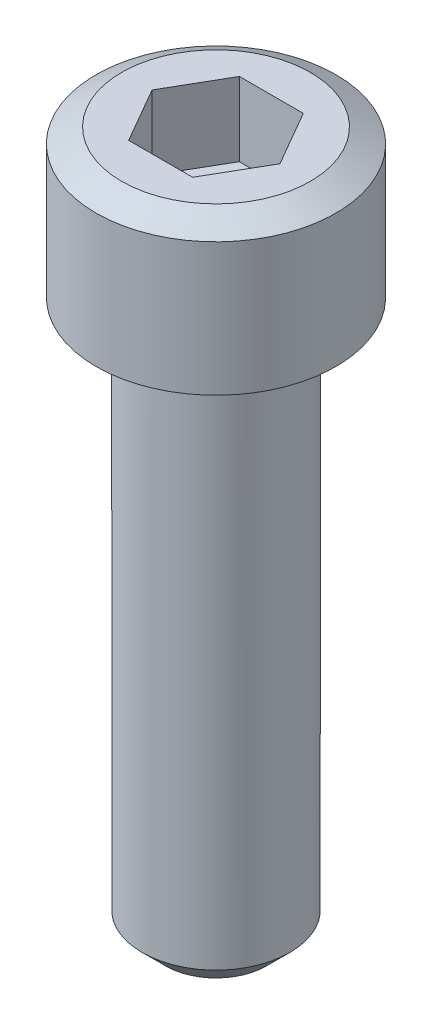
ISO-10303-21;
HEADER;
FILE_DESCRIPTION(('STEP AP214'),'2;1');
FILE_NAME('part.step','',(''),(''),'','','');
FILE_SCHEMA(('AUTOMOTIVE_DESIGN { 1 0 10303 214 1 1 1 1 }'));
ENDSEC;
DATA;
#1=APPLICATION_CONTEXT('core data for automotive mechanical design processes');
#2=APPLICATION_PROTOCOL_DEFINITION('international standard','automotive_design',2000,#1);
#3=PRODUCT_CONTEXT('',#1,'mechanical');
#4=PRODUCT('Part','Part','',(#3));
#5=PRODUCT_RELATED_PRODUCT_CATEGORY('part','',(#4));
#6=PRODUCT_DEFINITION_FORMATION('','',#4);
#7=PRODUCT_DEFINITION_CONTEXT('part definition',#1,'design');
#8=PRODUCT_DEFINITION('design','',#6,#7);
#9=PRODUCT_DEFINITION_SHAPE('','',#8);
#10=(LENGTH_UNIT() NAMED_UNIT(*) SI_UNIT(.MILLI.,.METRE.));
#11=(NAMED_UNIT(*) PLANE_ANGLE_UNIT() SI_UNIT($,.RADIAN.));
#12=(NAMED_UNIT(*) SI_UNIT($,.STERADIAN.) SOLID_ANGLE_UNIT());
#13=UNCERTAINTY_MEASURE_WITH_UNIT(LENGTH_MEASURE(1.E-05),#10,'distance_accuracy_value','');
#14=(GEOMETRIC_REPRESENTATION_CONTEXT(3) GLOBAL_UNCERTAINTY_ASSIGNED_CONTEXT((#13)) GLOBAL_UNIT_ASSIGNED_CONTEXT((#10,
#11,#12)) REPRESENTATION_CONTEXT('',''));
#15=CARTESIAN_POINT('',(0.,0.,0.));
#16=DIRECTION('',(0.,0.,1.));
#17=DIRECTION('',(1.,0.,0.));
#18=AXIS2_PLACEMENT_3D('',#15,#16,#17);
#19=CARTESIAN_POINT('',(0.,0.,0.));
#20=DIRECTION('',(0.,1.,0.));
#21=DIRECTION('',(0.,0.,1.));
#22=AXIS2_PLACEMENT_3D('',#19,#20,#21);
#23=PLANE('',#22);
#24=CARTESIAN_POINT('',(0.,0.,0.));
#25=DIRECTION('',(0.,1.,0.));
#26=DIRECTION('',(0.,0.,1.));
#27=AXIS2_PLACEMENT_3D('',#24,#25,#26);
#28=CIRCLE('',#27,6.5);
#29=CARTESIAN_POINT('',(0.,0.,6.5));
#30=VERTEX_POINT('',#29);
#31=EDGE_CURVE('E133',#30,#30,#28,.T.);
#32=ORIENTED_EDGE('',*,*,#31,.F.);
#33=EDGE_LOOP('',(#32));
#34=FACE_BOUND('',#33,.T.);
#35=CARTESIAN_POINT('',(0.,0.,0.));
#36=DIRECTION('',(0.,1.,0.));
#37=DIRECTION('',(0.,0.,1.));
#38=AXIS2_PLACEMENT_3D('',#35,#36,#37);
#39=CIRCLE('',#38,4.);
#40=CARTESIAN_POINT('',(0.,0.,4.));
#41=VERTEX_POINT('',#40);
#42=EDGE_CURVE('E148',#41,#41,#39,.F.);
#43=ORIENTED_EDGE('',*,*,#42,.F.);
#44=EDGE_LOOP('',(#43));
#45=FACE_BOUND('',#44,.T.);
#46=ADVANCED_FACE('F31',(#34,#45),#23,.F.);
#47=CARTESIAN_POINT('',(0.,8.,0.));
#48=DIRECTION('',(0.,-1.,0.));
#49=DIRECTION('',(0.,0.,-1.));
#50=AXIS2_PLACEMENT_3D('',#47,#48,#49);
#51=CYLINDRICAL_SURFACE('',#50,6.5);
#52=CARTESIAN_POINT('',(0.,7.2,0.));
#53=DIRECTION('',(0.,1.,0.));
#54=DIRECTION('',(0.,0.,1.));
#55=AXIS2_PLACEMENT_3D('',#52,#53,#54);
#56=CIRCLE('',#55,6.5);
#57=CARTESIAN_POINT('',(0.,7.2,6.5));
#58=VERTEX_POINT('',#57);
#59=EDGE_CURVE('E145',#58,#58,#56,.F.);
#60=ORIENTED_EDGE('',*,*,#59,.T.);
#61=EDGE_LOOP('',(#60));
#62=FACE_BOUND('',#61,.T.);
#63=ORIENTED_EDGE('',*,*,#31,.T.);
#64=EDGE_LOOP('',(#63));
#65=FACE_BOUND('',#64,.T.);
#66=ADVANCED_FACE('F33',(#62,#65),#51,.T.);
#67=CARTESIAN_POINT('',(0.,8.,0.));
#68=DIRECTION('',(0.,1.,0.));
#69=DIRECTION('',(0.,0.,1.));
#70=AXIS2_PLACEMENT_3D('',#67,#68,#69);
#71=PLANE('',#70);
#72=CARTESIAN_POINT('',(0.,8.,0.));
#73=DIRECTION('',(0.,1.,0.));
#74=DIRECTION('',(0.,0.,1.));
#75=AXIS2_PLACEMENT_3D('',#72,#73,#74);
#76=CIRCLE('',#75,5.1143593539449);
#77=CARTESIAN_POINT('',(0.,8.,5.1143593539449));
#78=VERTEX_POINT('',#77);
#79=EDGE_CURVE('E142',#78,#78,#76,.T.);
#80=ORIENTED_EDGE('',*,*,#79,.T.);
#81=EDGE_LOOP('',(#80));
#82=FACE_BOUND('',#81,.T.);
#83=DIRECTION('',(0.5,0.,-0.866025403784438));
#84=VECTOR('',#83,1.);
#85=CARTESIAN_POINT('',(1.73205080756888,8.,3.));
#86=LINE('',#85,#84);
#87=CARTESIAN_POINT('',(1.73205080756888,8.,3.));
#88=VERTEX_POINT('',#87);
#89=CARTESIAN_POINT('',(3.46410161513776,8.,0.));
#90=VERTEX_POINT('',#89);
#91=EDGE_CURVE('E46',#88,#90,#86,.T.);
#92=ORIENTED_EDGE('',*,*,#91,.F.);
#93=DIRECTION('',(1.,0.,0.));
#94=VECTOR('',#93,1.);
#95=CARTESIAN_POINT('',(-1.73205080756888,8.,3.));
#96=LINE('',#95,#94);
#97=CARTESIAN_POINT('',(-1.73205080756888,8.,3.));
#98=VERTEX_POINT('',#97);
#99=EDGE_CURVE('E115',#98,#88,#96,.T.);
#100=ORIENTED_EDGE('',*,*,#99,.F.);
#101=DIRECTION('',(0.5,0.,0.866025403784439));
#102=VECTOR('',#101,1.);
#103=CARTESIAN_POINT('',(-3.46410161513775,8.,0.));
#104=LINE('',#103,#102);
#105=CARTESIAN_POINT('',(-3.46410161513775,8.,0.));
#106=VERTEX_POINT('',#105);
#107=EDGE_CURVE('E109',#106,#98,#104,.T.);
#108=ORIENTED_EDGE('',*,*,#107,.F.);
#109=DIRECTION('',(-0.5,0.,0.866025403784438));
#110=VECTOR('',#109,1.);
#111=CARTESIAN_POINT('',(-1.73205080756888,8.,-3.));
#112=LINE('',#111,#110);
#113=CARTESIAN_POINT('',(-1.73205080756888,8.,-3.));
#114=VERTEX_POINT('',#113);
#115=EDGE_CURVE('E107',#114,#106,#112,.T.);
#116=ORIENTED_EDGE('',*,*,#115,.F.);
#117=DIRECTION('',(-1.,0.,0.));
#118=VECTOR('',#117,1.);
#119=CARTESIAN_POINT('',(1.73205080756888,8.,-3.));
#120=LINE('',#119,#118);
#121=CARTESIAN_POINT('',(1.73205080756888,8.,-3.));
#122=VERTEX_POINT('',#121);
#123=EDGE_CURVE('E89',#122,#114,#120,.T.);
#124=ORIENTED_EDGE('',*,*,#123,.F.);
#125=DIRECTION('',(-0.5,0.,-0.866025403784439));
#126=VECTOR('',#125,1.);
#127=CARTESIAN_POINT('',(3.46410161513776,8.,0.));
#128=LINE('',#127,#126);
#129=EDGE_CURVE('E100',#90,#122,#128,.T.);
#130=ORIENTED_EDGE('',*,*,#129,.F.);
#131=EDGE_LOOP('',(#92,#100,#108,#116,#124,#130));
#132=FACE_BOUND('',#131,.T.);
#133=ADVANCED_FACE('F104',(#82,#132),#71,.T.);
#134=CARTESIAN_POINT('',(1.73205080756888,4.,3.));
#135=DIRECTION('',(0.866025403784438,0.,0.5));
#136=DIRECTION('',(0.5,0.,-0.866025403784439));
#137=AXIS2_PLACEMENT_3D('',#134,#135,#136);
#138=PLANE('',#137);
#139=ORIENTED_EDGE('',*,*,#91,.T.);
#140=DIRECTION('',(0.,1.,0.));
#141=VECTOR('',#140,1.);
#142=CARTESIAN_POINT('',(3.46410161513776,4.,0.));
#143=LINE('',#142,#141);
#144=CARTESIAN_POINT('',(3.46410161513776,4.,0.));
#145=VERTEX_POINT('',#144);
#146=EDGE_CURVE('E97',#145,#90,#143,.T.);
#147=ORIENTED_EDGE('',*,*,#146,.F.);
#148=DIRECTION('',(0.5,0.,-0.866025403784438));
#149=VECTOR('',#148,1.);
#150=CARTESIAN_POINT('',(1.73205080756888,4.,3.));
#151=LINE('',#150,#149);
#152=CARTESIAN_POINT('',(1.73205080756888,4.,3.));
#153=VERTEX_POINT('',#152);
#154=EDGE_CURVE('E117',#153,#145,#151,.T.);
#155=ORIENTED_EDGE('',*,*,#154,.F.);
#156=DIRECTION('',(0.,1.,0.));
#157=VECTOR('',#156,1.);
#158=CARTESIAN_POINT('',(1.73205080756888,4.,3.));
#159=LINE('',#158,#157);
#160=EDGE_CURVE('E53',#153,#88,#159,.T.);
#161=ORIENTED_EDGE('',*,*,#160,.T.);
#162=EDGE_LOOP('',(#139,#147,#155,#161));
#163=FACE_BOUND('',#162,.T.);
#164=ADVANCED_FACE('F175',(#163),#138,.F.);
#165=CARTESIAN_POINT('',(-1.73205080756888,4.,3.));
#166=DIRECTION('',(0.,0.,1.));
#167=DIRECTION('',(1.,0.,0.));
#168=AXIS2_PLACEMENT_3D('',#165,#166,#167);
#169=PLANE('',#168);
#170=ORIENTED_EDGE('',*,*,#99,.T.);
#171=ORIENTED_EDGE('',*,*,#160,.F.);
#172=DIRECTION('',(1.,0.,0.));
#173=VECTOR('',#172,1.);
#174=CARTESIAN_POINT('',(-1.73205080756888,4.,3.));
#175=LINE('',#174,#173);
#176=CARTESIAN_POINT('',(-1.73205080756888,4.,3.));
#177=VERTEX_POINT('',#176);
#178=EDGE_CURVE('E129',#177,#153,#175,.T.);
#179=ORIENTED_EDGE('',*,*,#178,.F.);
#180=DIRECTION('',(0.,1.,0.));
#181=VECTOR('',#180,1.);
#182=CARTESIAN_POINT('',(-1.73205080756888,4.,3.));
#183=LINE('',#182,#181);
#184=EDGE_CURVE('E134',#177,#98,#183,.T.);
#185=ORIENTED_EDGE('',*,*,#184,.T.);
#186=EDGE_LOOP('',(#170,#171,#179,#185));
#187=FACE_BOUND('',#186,.T.);
#188=ADVANCED_FACE('F182',(#187),#169,.F.);
#189=CARTESIAN_POINT('',(-3.46410161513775,4.,0.));
#190=DIRECTION('',(-0.866025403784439,0.,0.5));
#191=DIRECTION('',(0.5,0.,0.866025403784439));
#192=AXIS2_PLACEMENT_3D('',#189,#190,#191);
#193=PLANE('',#192);
#194=ORIENTED_EDGE('',*,*,#107,.T.);
#195=ORIENTED_EDGE('',*,*,#184,.F.);
#196=DIRECTION('',(0.5,0.,0.866025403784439));
#197=VECTOR('',#196,1.);
#198=CARTESIAN_POINT('',(-3.46410161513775,4.,0.));
#199=LINE('',#198,#197);
#200=CARTESIAN_POINT('',(-3.46410161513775,4.,0.));
#201=VERTEX_POINT('',#200);
#202=EDGE_CURVE('E126',#201,#177,#199,.T.);
#203=ORIENTED_EDGE('',*,*,#202,.F.);
#204=DIRECTION('',(0.,1.,0.));
#205=VECTOR('',#204,1.);
#206=CARTESIAN_POINT('',(-3.46410161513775,4.,0.));
#207=LINE('',#206,#205);
#208=EDGE_CURVE('E136',#201,#106,#207,.T.);
#209=ORIENTED_EDGE('',*,*,#208,.T.);
#210=EDGE_LOOP('',(#194,#195,#203,#209));
#211=FACE_BOUND('',#210,.T.);
#212=ADVANCED_FACE('F202',(#211),#193,.F.);
#213=CARTESIAN_POINT('',(-1.73205080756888,4.,-3.));
#214=DIRECTION('',(-0.866025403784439,0.,-0.5));
#215=DIRECTION('',(-0.5,0.,0.866025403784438));
#216=AXIS2_PLACEMENT_3D('',#213,#214,#215);
#217=PLANE('',#216);
#218=ORIENTED_EDGE('',*,*,#115,.T.);
#219=ORIENTED_EDGE('',*,*,#208,.F.);
#220=DIRECTION('',(-0.5,0.,0.866025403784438));
#221=VECTOR('',#220,1.);
#222=CARTESIAN_POINT('',(-1.73205080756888,4.,-3.));
#223=LINE('',#222,#221);
#224=CARTESIAN_POINT('',(-1.73205080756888,4.,-3.));
#225=VERTEX_POINT('',#224);
#226=EDGE_CURVE('E123',#225,#201,#223,.T.);
#227=ORIENTED_EDGE('',*,*,#226,.F.);
#228=DIRECTION('',(0.,1.,0.));
#229=VECTOR('',#228,1.);
#230=CARTESIAN_POINT('',(-1.73205080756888,4.,-3.));
#231=LINE('',#230,#229);
#232=EDGE_CURVE('E96',#225,#114,#231,.T.);
#233=ORIENTED_EDGE('',*,*,#232,.T.);
#234=EDGE_LOOP('',(#218,#219,#227,#233));
#235=FACE_BOUND('',#234,.T.);
#236=ADVANCED_FACE('F205',(#235),#217,.F.);
#237=CARTESIAN_POINT('',(1.73205080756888,4.,-3.));
#238=DIRECTION('',(0.,0.,-1.));
#239=DIRECTION('',(-1.,0.,0.));
#240=AXIS2_PLACEMENT_3D('',#237,#238,#239);
#241=PLANE('',#240);
#242=ORIENTED_EDGE('',*,*,#123,.T.);
#243=ORIENTED_EDGE('',*,*,#232,.F.);
#244=DIRECTION('',(-1.,0.,0.));
#245=VECTOR('',#244,1.);
#246=CARTESIAN_POINT('',(1.73205080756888,4.,-3.));
#247=LINE('',#246,#245);
#248=CARTESIAN_POINT('',(1.73205080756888,4.,-3.));
#249=VERTEX_POINT('',#248);
#250=EDGE_CURVE('E92',#249,#225,#247,.T.);
#251=ORIENTED_EDGE('',*,*,#250,.F.);
#252=DIRECTION('',(0.,1.,0.));
#253=VECTOR('',#252,1.);
#254=CARTESIAN_POINT('',(1.73205080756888,4.,-3.));
#255=LINE('',#254,#253);
#256=EDGE_CURVE('E85',#249,#122,#255,.T.);
#257=ORIENTED_EDGE('',*,*,#256,.T.);
#258=EDGE_LOOP('',(#242,#243,#251,#257));
#259=FACE_BOUND('',#258,.T.);
#260=ADVANCED_FACE('F87',(#259),#241,.F.);
#261=CARTESIAN_POINT('',(3.46410161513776,4.,0.));
#262=DIRECTION('',(0.866025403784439,0.,-0.5));
#263=DIRECTION('',(-0.5,0.,-0.866025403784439));
#264=AXIS2_PLACEMENT_3D('',#261,#262,#263);
#265=PLANE('',#264);
#266=ORIENTED_EDGE('',*,*,#129,.T.);
#267=ORIENTED_EDGE('',*,*,#256,.F.);
#268=DIRECTION('',(-0.5,0.,-0.866025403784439));
#269=VECTOR('',#268,1.);
#270=CARTESIAN_POINT('',(3.46410161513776,4.,0.));
#271=LINE('',#270,#269);
#272=EDGE_CURVE('E120',#145,#249,#271,.T.);
#273=ORIENTED_EDGE('',*,*,#272,.F.);
#274=ORIENTED_EDGE('',*,*,#146,.T.);
#275=EDGE_LOOP('',(#266,#267,#273,#274));
#276=FACE_BOUND('',#275,.T.);
#277=ADVANCED_FACE('F101',(#276),#265,.F.);
#278=CARTESIAN_POINT('',(3.46410161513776,4.,0.));
#279=DIRECTION('',(0.,1.,0.));
#280=DIRECTION('',(0.,0.,1.));
#281=AXIS2_PLACEMENT_3D('',#278,#279,#280);
#282=PLANE('',#281);
#283=ORIENTED_EDGE('',*,*,#154,.T.);
#284=ORIENTED_EDGE('',*,*,#272,.T.);
#285=ORIENTED_EDGE('',*,*,#250,.T.);
#286=ORIENTED_EDGE('',*,*,#226,.T.);
#287=ORIENTED_EDGE('',*,*,#202,.T.);
#288=ORIENTED_EDGE('',*,*,#178,.T.);
#289=EDGE_LOOP('',(#283,#284,#285,#286,#287,#288));
#290=FACE_BOUND('',#289,.T.);
#291=ADVANCED_FACE('F187',(#290),#282,.T.);
#292=CARTESIAN_POINT('',(0.,8.,0.));
#293=DIRECTION('',(0.,-1.,0.));
#294=DIRECTION('',(0.,0.,-1.));
#295=AXIS2_PLACEMENT_3D('',#292,#293,#294);
#296=CONICAL_SURFACE('',#295,5.1143593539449,1.0471975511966);
#297=ORIENTED_EDGE('',*,*,#59,.F.);
#298=EDGE_LOOP('',(#297));
#299=FACE_BOUND('',#298,.T.);
#300=ORIENTED_EDGE('',*,*,#79,.F.);
#301=EDGE_LOOP('',(#300));
#302=FACE_BOUND('',#301,.T.);
#303=ADVANCED_FACE('F185',(#299,#302),#296,.T.);
#304=CARTESIAN_POINT('',(0.,-30.,0.));
#305=DIRECTION('',(0.,1.,0.));
#306=DIRECTION('',(0.,0.,1.));
#307=AXIS2_PLACEMENT_3D('',#304,#305,#306);
#308=CYLINDRICAL_SURFACE('',#307,4.);
#309=CARTESIAN_POINT('',(0.,-28.75,0.));
#310=DIRECTION('',(0.,-1.,0.));
#311=DIRECTION('',(0.,0.,-1.));
#312=AXIS2_PLACEMENT_3D('',#309,#310,#311);
#313=CIRCLE('',#312,4.);
#314=CARTESIAN_POINT('',(0.,-28.75,-4.));
#315=VERTEX_POINT('',#314);
#316=EDGE_CURVE('E11',#315,#315,#313,.F.);
#317=ORIENTED_EDGE('',*,*,#316,.T.);
#318=EDGE_LOOP('',(#317));
#319=FACE_BOUND('',#318,.T.);
#320=ORIENTED_EDGE('',*,*,#42,.T.);
#321=EDGE_LOOP('',(#320));
#322=FACE_BOUND('',#321,.T.);
#323=ADVANCED_FACE('F162',(#319,#322),#308,.T.);
#324=CARTESIAN_POINT('',(0.,-30.,0.));
#325=DIRECTION('',(0.,-1.,0.));
#326=DIRECTION('',(0.,0.,-1.));
#327=AXIS2_PLACEMENT_3D('',#324,#325,#326);
#328=PLANE('',#327);
#329=CARTESIAN_POINT('',(0.,-30.,0.));
#330=DIRECTION('',(0.,-1.,0.));
#331=DIRECTION('',(0.,0.,-1.));
#332=AXIS2_PLACEMENT_3D('',#329,#330,#331);
#333=CIRCLE('',#332,2.75);
#334=CARTESIAN_POINT('',(0.,-30.,-2.75));
#335=VERTEX_POINT('',#334);
#336=EDGE_CURVE('E39',#335,#335,#333,.T.);
#337=ORIENTED_EDGE('',*,*,#336,.T.);
#338=EDGE_LOOP('',(#337));
#339=FACE_BOUND('',#338,.T.);
#340=ADVANCED_FACE('F153',(#339),#328,.T.);
#341=CARTESIAN_POINT('',(0.,-30.,0.));
#342=DIRECTION('',(0.,1.,0.));
#343=DIRECTION('',(0.,0.,1.));
#344=AXIS2_PLACEMENT_3D('',#341,#342,#343);
#345=CONICAL_SURFACE('',#344,2.75,0.785398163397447);
#346=ORIENTED_EDGE('',*,*,#316,.F.);
#347=EDGE_LOOP('',(#346));
#348=FACE_BOUND('',#347,.T.);
#349=ORIENTED_EDGE('',*,*,#336,.F.);
#350=EDGE_LOOP('',(#349));
#351=FACE_BOUND('',#350,.T.);
#352=ADVANCED_FACE('F155',(#348,#351),#345,.T.);
#353=CLOSED_SHELL('',(#46,#66,#133,#164,#188,#212,#236,#260,#277,#291,#303,#323,#340,#352));
#354=MANIFOLD_SOLID_BREP('B2',#353);
#355=ADVANCED_BREP_SHAPE_REPRESENTATION('',(#18,#354),#14);
#356=SHAPE_DEFINITION_REPRESENTATION(#9,#355);
ENDSEC;
END-ISO-10303-21;
